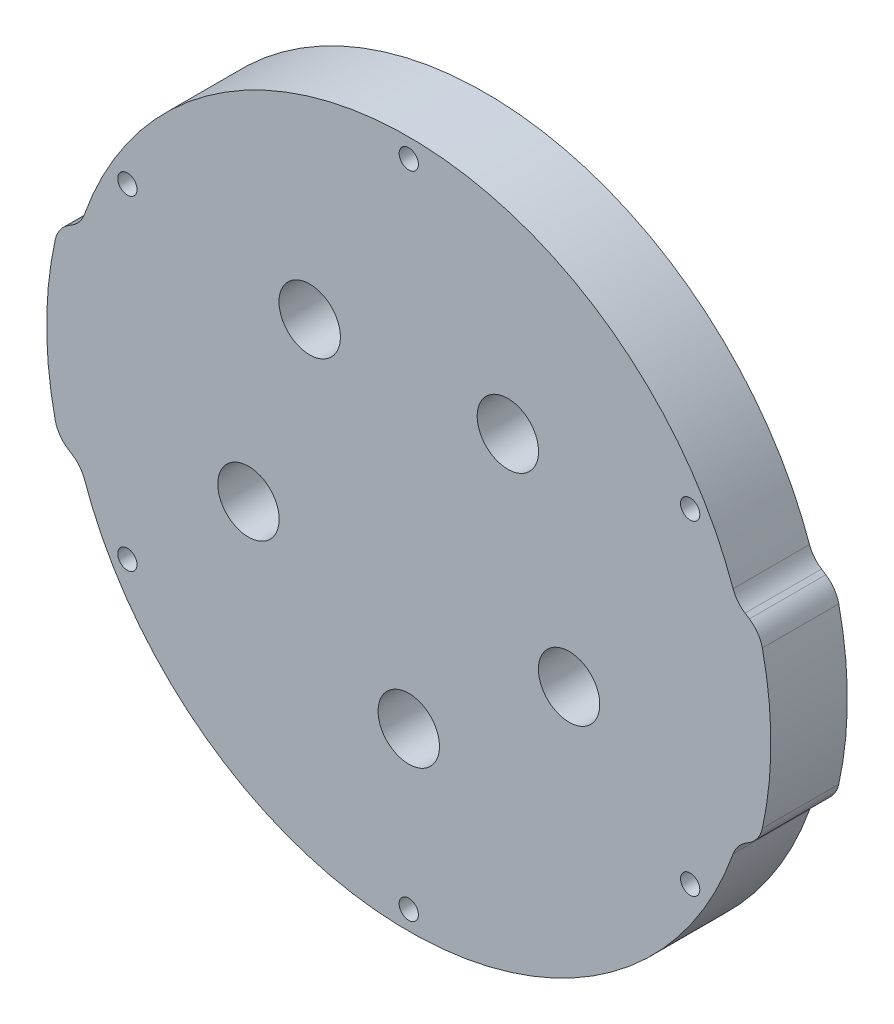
from build123d import *

# Parameters (mm, degrees)
SKETCH1_R           = 1.6
BOSS_EXTRUDE1_DEPTH = 12.7
SKETCH6_R           = 5.1
CUT_EXTRUDE2_DEPTH  = 84.937089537
FILLET1_R           = 5


with BuildPart() as part:
    # Sketch1 → Boss-Extrude1 (new body)
    with BuildSketch(Plane.XY):
        with BuildLine():
            Line((54.404710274, 17.5), (58.249656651, 15))
            ThreePointArc((58.249656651, 15), (60.15, 0), (58.249656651, -15))
            Line((58.249656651, -15), (54.404710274, -17.5))
            ThreePointArc((54.404710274, -17.5), (0, -57.15), (-54.404710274, -17.5))
            Line((-54.404710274, -17.5), (-58.249656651, -15))
            ThreePointArc((-58.249656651, -15), (-60.15, 0), (-58.249656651, 15))
            Line((-58.249656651, 15), (-54.404710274, 17.5))
            ThreePointArc((-54.404710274, 17.5), (0, 57.15), (54.404710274, 17.5))
        make_face()
        with Locations((0, 53.975)):
            Circle(SKETCH1_R, mode=Mode.SUBTRACT)
        with Locations((46.743721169, 26.9875)):
            Circle(SKETCH1_R, mode=Mode.SUBTRACT)
        with Locations((46.743721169, -26.9875)):
            Circle(SKETCH1_R, mode=Mode.SUBTRACT)
        with Locations((0, -53.975)):
            Circle(SKETCH1_R, mode=Mode.SUBTRACT)
        with Locations((-46.743721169, -26.9875)):
            Circle(SKETCH1_R, mode=Mode.SUBTRACT)
        with Locations((-46.743721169, 26.9875)):
            Circle(SKETCH1_R, mode=Mode.SUBTRACT)
    extrude(amount=BOSS_EXTRUDE1_DEPTH)

    # Sketch6 → Cut-Extrude2 (cut, through all)
    with BuildSketch(Plane(origin=(0, 0, 0), x_dir=(-1, 0, 0), z_dir=(0, 0, -1))):
        with Locations((16.457987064, 22.652475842)):
            Circle(SKETCH6_R)
        with Locations((-26.629582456, -8.652475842)):
            Circle(SKETCH6_R)
        with Locations((26.629582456, -8.652475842)):
            Circle(SKETCH6_R)
        with Locations((-16.457987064, 22.652475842)):
            Circle(SKETCH6_R)
        with Locations((0, -28)):
            Circle(SKETCH6_R)
    extrude(amount=-CUT_EXTRUDE2_DEPTH, mode=Mode.SUBTRACT)

    # Fillet1
    fillet1_edges = [part.edges().sort_by_distance(p)[0] for p in [
        (54.404710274, 17.5, 6.35),
        (58.249656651, 15, 6.35),
        (58.249656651, -15, 6.35),
        (54.404710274, -17.5, 6.35),
        (-54.404710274, -17.5, 6.35),
        (-58.249656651, -15, 6.35),
        (-58.249656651, 15, 6.35),
        (-54.404710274, 17.5, 6.35),
    ]]
    fillet(fillet1_edges, radius=FILLET1_R)


solid = part.part
